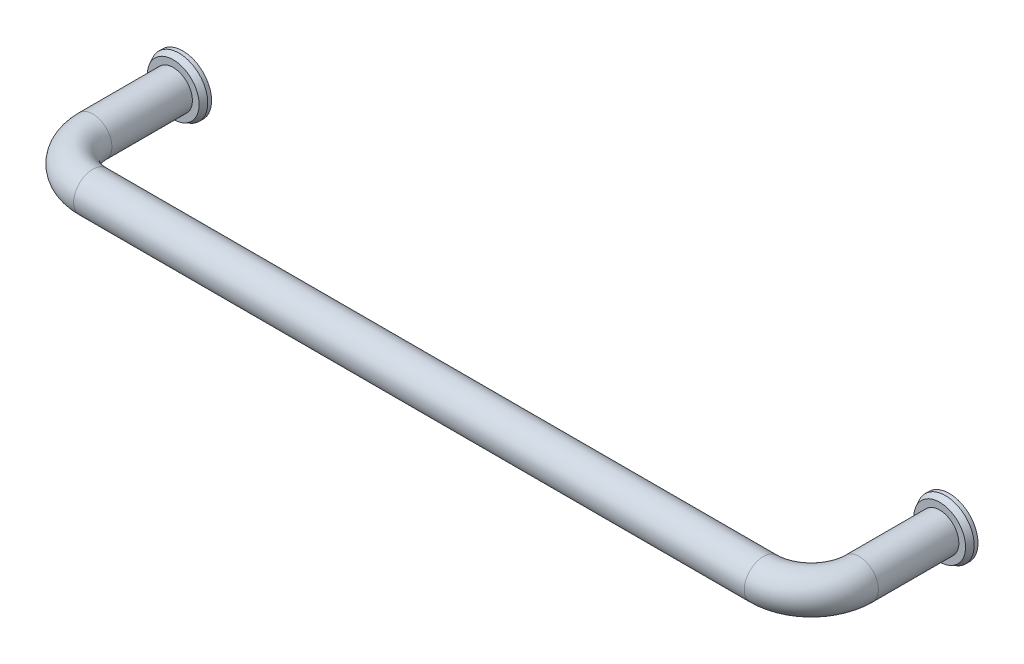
ISO-10303-21;
HEADER;
FILE_DESCRIPTION(('STEP AP214'),'2;1');
FILE_NAME('part.step','',(''),(''),'','','');
FILE_SCHEMA(('AUTOMOTIVE_DESIGN { 1 0 10303 214 1 1 1 1 }'));
ENDSEC;
DATA;
#1=APPLICATION_CONTEXT('core data for automotive mechanical design processes');
#2=APPLICATION_PROTOCOL_DEFINITION('international standard','automotive_design',2000,#1);
#3=PRODUCT_CONTEXT('',#1,'mechanical');
#4=PRODUCT('Part','Part','',(#3));
#5=PRODUCT_RELATED_PRODUCT_CATEGORY('part','',(#4));
#6=PRODUCT_DEFINITION_FORMATION('','',#4);
#7=PRODUCT_DEFINITION_CONTEXT('part definition',#1,'design');
#8=PRODUCT_DEFINITION('design','',#6,#7);
#9=PRODUCT_DEFINITION_SHAPE('','',#8);
#10=(LENGTH_UNIT() NAMED_UNIT(*) SI_UNIT(.MILLI.,.METRE.));
#11=(NAMED_UNIT(*) PLANE_ANGLE_UNIT() SI_UNIT($,.RADIAN.));
#12=(NAMED_UNIT(*) SI_UNIT($,.STERADIAN.) SOLID_ANGLE_UNIT());
#13=UNCERTAINTY_MEASURE_WITH_UNIT(LENGTH_MEASURE(1.E-05),#10,'distance_accuracy_value','');
#14=(GEOMETRIC_REPRESENTATION_CONTEXT(3) GLOBAL_UNCERTAINTY_ASSIGNED_CONTEXT((#13)) GLOBAL_UNIT_ASSIGNED_CONTEXT((#10,
#11,#12)) REPRESENTATION_CONTEXT('',''));
#15=CARTESIAN_POINT('',(0.,0.,0.));
#16=DIRECTION('',(0.,0.,1.));
#17=DIRECTION('',(1.,0.,0.));
#18=AXIS2_PLACEMENT_3D('',#15,#16,#17);
#19=CARTESIAN_POINT('',(0.,0.,0.));
#20=DIRECTION('',(0.,0.,-1.));
#21=DIRECTION('',(0.,1.,0.));
#22=AXIS2_PLACEMENT_3D('',#19,#20,#21);
#23=PLANE('',#22);
#24=CARTESIAN_POINT('',(0.,0.,0.));
#25=DIRECTION('',(0.,0.,1.));
#26=DIRECTION('',(0.,-1.,0.));
#27=AXIS2_PLACEMENT_3D('',#24,#25,#26);
#28=CIRCLE('',#27,7.5);
#29=CARTESIAN_POINT('',(0.,-7.5,0.));
#30=VERTEX_POINT('',#29);
#31=EDGE_CURVE('E56',#30,#30,#28,.T.);
#32=ORIENTED_EDGE('',*,*,#31,.F.);
#33=EDGE_LOOP('',(#32));
#34=FACE_BOUND('',#33,.T.);
#35=CARTESIAN_POINT('',(0.,0.,0.));
#36=DIRECTION('',(0.,0.,1.));
#37=DIRECTION('',(0.,-1.,0.));
#38=AXIS2_PLACEMENT_3D('',#35,#36,#37);
#39=CIRCLE('',#38,2.5);
#40=CARTESIAN_POINT('',(0.,-2.5,0.));
#41=VERTEX_POINT('',#40);
#42=EDGE_CURVE('E62',#41,#41,#39,.T.);
#43=ORIENTED_EDGE('',*,*,#42,.T.);
#44=EDGE_LOOP('',(#43));
#45=FACE_BOUND('',#44,.T.);
#46=ADVANCED_FACE('F12',(#34,#45),#23,.T.);
#47=CARTESIAN_POINT('',(0.,0.,23.5));
#48=DIRECTION('',(0.,0.,-1.));
#49=DIRECTION('',(0.,-1.,0.));
#50=AXIS2_PLACEMENT_3D('',#47,#48,#49);
#51=CYLINDRICAL_SURFACE('',#50,5.);
#52=CARTESIAN_POINT('',(0.,0.,23.5));
#53=DIRECTION('',(0.,0.,-1.));
#54=DIRECTION('',(0.,1.,0.));
#55=AXIS2_PLACEMENT_3D('',#52,#53,#54);
#56=CIRCLE('',#55,5.);
#57=CARTESIAN_POINT('',(-5.,0.,23.5));
#58=VERTEX_POINT('',#57);
#59=EDGE_CURVE('E20',#58,#58,#56,.T.);
#60=ORIENTED_EDGE('',*,*,#59,.T.);
#61=EDGE_LOOP('',(#60));
#62=FACE_BOUND('',#61,.T.);
#63=CARTESIAN_POINT('',(0.,0.,2.5));
#64=DIRECTION('',(0.,0.,-1.));
#65=DIRECTION('',(0.,-1.,0.));
#66=AXIS2_PLACEMENT_3D('',#63,#64,#65);
#67=CIRCLE('',#66,5.);
#68=CARTESIAN_POINT('',(0.,-5.,2.5));
#69=VERTEX_POINT('',#68);
#70=EDGE_CURVE('E16',#69,#69,#67,.F.);
#71=ORIENTED_EDGE('',*,*,#70,.T.);
#72=EDGE_LOOP('',(#71));
#73=FACE_BOUND('',#72,.T.);
#74=ADVANCED_FACE('F14',(#62,#73),#51,.T.);
#75=CARTESIAN_POINT('',(200.,0.,23.5));
#76=DIRECTION('',(0.,0.,-1.));
#77=DIRECTION('',(0.,-1.,0.));
#78=AXIS2_PLACEMENT_3D('',#75,#76,#77);
#79=CYLINDRICAL_SURFACE('',#78,5.);
#80=CARTESIAN_POINT('',(200.,0.,23.5));
#81=DIRECTION('',(0.,0.,1.));
#82=DIRECTION('',(0.,1.,0.));
#83=AXIS2_PLACEMENT_3D('',#80,#81,#82);
#84=CIRCLE('',#83,5.);
#85=CARTESIAN_POINT('',(205.,0.,23.5));
#86=VERTEX_POINT('',#85);
#87=EDGE_CURVE('E32',#86,#86,#84,.T.);
#88=ORIENTED_EDGE('',*,*,#87,.F.);
#89=EDGE_LOOP('',(#88));
#90=FACE_BOUND('',#89,.T.);
#91=CARTESIAN_POINT('',(200.,0.,2.5));
#92=DIRECTION('',(0.,0.,-1.));
#93=DIRECTION('',(0.,-1.,0.));
#94=AXIS2_PLACEMENT_3D('',#91,#92,#93);
#95=CIRCLE('',#94,5.);
#96=CARTESIAN_POINT('',(200.,-5.,2.5));
#97=VERTEX_POINT('',#96);
#98=EDGE_CURVE('E8',#97,#97,#95,.T.);
#99=ORIENTED_EDGE('',*,*,#98,.F.);
#100=EDGE_LOOP('',(#99));
#101=FACE_BOUND('',#100,.T.);
#102=ADVANCED_FACE('F91',(#90,#101),#79,.T.);
#103=CARTESIAN_POINT('',(12.5,0.,23.5));
#104=DIRECTION('',(0.,-1.,0.));
#105=DIRECTION('',(1.,0.,0.));
#106=AXIS2_PLACEMENT_3D('',#103,#104,#105);
#107=TOROIDAL_SURFACE('',#106,12.5,5.);
#108=CARTESIAN_POINT('',(12.5,0.,36.));
#109=DIRECTION('',(-1.,0.,0.));
#110=DIRECTION('',(0.,1.,0.));
#111=AXIS2_PLACEMENT_3D('',#108,#109,#110);
#112=CIRCLE('',#111,5.);
#113=CARTESIAN_POINT('',(12.5,0.,41.));
#114=VERTEX_POINT('',#113);
#115=EDGE_CURVE('E24',#114,#114,#112,.T.);
#116=CARTESIAN_POINT('',(12.5,0.,23.5));
#117=DIRECTION('',(0.,-1.,0.));
#118=DIRECTION('',(1.,0.,0.));
#119=AXIS2_PLACEMENT_3D('',#116,#117,#118);
#120=CIRCLE('',#119,17.5);
#121=EDGE_CURVE('',#114,#58,#120,.T.);
#122=ORIENTED_EDGE('',*,*,#115,.T.);
#123=ORIENTED_EDGE('',*,*,#59,.F.);
#124=ORIENTED_EDGE('',*,*,#121,.T.);
#125=ORIENTED_EDGE('',*,*,#121,.F.);
#126=EDGE_LOOP('',(#122,#124,#123,#125));
#127=FACE_BOUND('',#126,.T.);
#128=ADVANCED_FACE('F100',(#127),#107,.T.);
#129=CARTESIAN_POINT('',(187.5,0.,36.));
#130=DIRECTION('',(-1.,0.,0.));
#131=DIRECTION('',(0.,-1.,0.));
#132=AXIS2_PLACEMENT_3D('',#129,#130,#131);
#133=CYLINDRICAL_SURFACE('',#132,5.);
#134=CARTESIAN_POINT('',(187.5,0.,36.));
#135=DIRECTION('',(-1.,0.,0.));
#136=DIRECTION('',(0.,1.,0.));
#137=AXIS2_PLACEMENT_3D('',#134,#135,#136);
#138=CIRCLE('',#137,5.);
#139=CARTESIAN_POINT('',(187.5,0.,41.));
#140=VERTEX_POINT('',#139);
#141=EDGE_CURVE('E29',#140,#140,#138,.T.);
#142=ORIENTED_EDGE('',*,*,#141,.T.);
#143=EDGE_LOOP('',(#142));
#144=FACE_BOUND('',#143,.T.);
#145=ORIENTED_EDGE('',*,*,#115,.F.);
#146=EDGE_LOOP('',(#145));
#147=FACE_BOUND('',#146,.T.);
#148=ADVANCED_FACE('F106',(#144,#147),#133,.T.);
#149=CARTESIAN_POINT('',(187.5,0.,23.5));
#150=DIRECTION('',(0.,-1.,0.));
#151=DIRECTION('',(1.,0.,0.));
#152=AXIS2_PLACEMENT_3D('',#149,#150,#151);
#153=TOROIDAL_SURFACE('',#152,12.5,5.);
#154=CARTESIAN_POINT('',(187.5,0.,23.5));
#155=DIRECTION('',(0.,-1.,0.));
#156=DIRECTION('',(1.,0.,0.));
#157=AXIS2_PLACEMENT_3D('',#154,#155,#156);
#158=CIRCLE('',#157,17.5);
#159=EDGE_CURVE('',#86,#140,#158,.T.);
#160=ORIENTED_EDGE('',*,*,#87,.T.);
#161=ORIENTED_EDGE('',*,*,#141,.F.);
#162=ORIENTED_EDGE('',*,*,#159,.T.);
#163=ORIENTED_EDGE('',*,*,#159,.F.);
#164=EDGE_LOOP('',(#160,#162,#161,#163));
#165=FACE_BOUND('',#164,.T.);
#166=ADVANCED_FACE('F102',(#165),#153,.T.);
#167=CARTESIAN_POINT('',(200.,0.,2.5));
#168=DIRECTION('',(0.,0.,-1.));
#169=DIRECTION('',(0.,-1.,0.));
#170=AXIS2_PLACEMENT_3D('',#167,#168,#169);
#171=PLANE('',#170);
#172=CARTESIAN_POINT('',(200.,0.,2.5));
#173=DIRECTION('',(0.,0.,-1.));
#174=DIRECTION('',(0.,-1.,0.));
#175=AXIS2_PLACEMENT_3D('',#172,#173,#174);
#176=CIRCLE('',#175,6.75);
#177=CARTESIAN_POINT('',(200.,-6.75,2.5));
#178=VERTEX_POINT('',#177);
#179=EDGE_CURVE('E35',#178,#178,#176,.T.);
#180=ORIENTED_EDGE('',*,*,#179,.F.);
#181=EDGE_LOOP('',(#180));
#182=FACE_BOUND('',#181,.T.);
#183=ORIENTED_EDGE('',*,*,#98,.T.);
#184=EDGE_LOOP('',(#183));
#185=FACE_BOUND('',#184,.T.);
#186=ADVANCED_FACE('F105',(#182,#185),#171,.F.);
#187=CARTESIAN_POINT('',(200.,0.,2.5));
#188=DIRECTION('',(0.,0.,-1.));
#189=DIRECTION('',(0.,-1.,0.));
#190=AXIS2_PLACEMENT_3D('',#187,#188,#189);
#191=CONICAL_SURFACE('',#190,6.75,0.463647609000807);
#192=CARTESIAN_POINT('',(200.,0.,0.999999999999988));
#193=DIRECTION('',(0.,0.,-1.));
#194=DIRECTION('',(0.,-1.,0.));
#195=AXIS2_PLACEMENT_3D('',#192,#193,#194);
#196=CIRCLE('',#195,7.5);
#197=CARTESIAN_POINT('',(200.,-7.5,0.999999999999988));
#198=VERTEX_POINT('',#197);
#199=EDGE_CURVE('E38',#198,#198,#196,.T.);
#200=ORIENTED_EDGE('',*,*,#199,.F.);
#201=EDGE_LOOP('',(#200));
#202=FACE_BOUND('',#201,.T.);
#203=ORIENTED_EDGE('',*,*,#179,.T.);
#204=EDGE_LOOP('',(#203));
#205=FACE_BOUND('',#204,.T.);
#206=ADVANCED_FACE('F146',(#202,#205),#191,.T.);
#207=CARTESIAN_POINT('',(200.,0.,0.));
#208=DIRECTION('',(0.,0.,-1.));
#209=DIRECTION('',(0.,-1.,0.));
#210=AXIS2_PLACEMENT_3D('',#207,#208,#209);
#211=CYLINDRICAL_SURFACE('',#210,7.5);
#212=CARTESIAN_POINT('',(200.,0.,0.));
#213=DIRECTION('',(0.,0.,-1.));
#214=DIRECTION('',(0.,-1.,0.));
#215=AXIS2_PLACEMENT_3D('',#212,#213,#214);
#216=CIRCLE('',#215,7.5);
#217=CARTESIAN_POINT('',(200.,-7.5,0.));
#218=VERTEX_POINT('',#217);
#219=EDGE_CURVE('E41',#218,#218,#216,.T.);
#220=ORIENTED_EDGE('',*,*,#219,.F.);
#221=EDGE_LOOP('',(#220));
#222=FACE_BOUND('',#221,.T.);
#223=ORIENTED_EDGE('',*,*,#199,.T.);
#224=EDGE_LOOP('',(#223));
#225=FACE_BOUND('',#224,.T.);
#226=ADVANCED_FACE('F143',(#222,#225),#211,.T.);
#227=CARTESIAN_POINT('',(200.,0.,0.));
#228=DIRECTION('',(0.,0.,1.));
#229=DIRECTION('',(0.,1.,0.));
#230=AXIS2_PLACEMENT_3D('',#227,#228,#229);
#231=PLANE('',#230);
#232=CARTESIAN_POINT('',(200.,0.,0.));
#233=DIRECTION('',(0.,0.,-1.));
#234=DIRECTION('',(0.,-1.,0.));
#235=AXIS2_PLACEMENT_3D('',#232,#233,#234);
#236=CIRCLE('',#235,2.5);
#237=CARTESIAN_POINT('',(200.,-2.5,0.));
#238=VERTEX_POINT('',#237);
#239=EDGE_CURVE('E47',#238,#238,#236,.T.);
#240=ORIENTED_EDGE('',*,*,#239,.F.);
#241=EDGE_LOOP('',(#240));
#242=FACE_BOUND('',#241,.T.);
#243=ORIENTED_EDGE('',*,*,#219,.T.);
#244=EDGE_LOOP('',(#243));
#245=FACE_BOUND('',#244,.T.);
#246=ADVANCED_FACE('F96',(#242,#245),#231,.F.);
#247=CARTESIAN_POINT('',(200.,0.,11.));
#248=DIRECTION('',(0.,0.,-1.));
#249=DIRECTION('',(0.,-1.,0.));
#250=AXIS2_PLACEMENT_3D('',#247,#248,#249);
#251=CYLINDRICAL_SURFACE('',#250,2.5);
#252=CARTESIAN_POINT('',(200.,0.,11.));
#253=DIRECTION('',(0.,0.,-1.));
#254=DIRECTION('',(0.,-1.,0.));
#255=AXIS2_PLACEMENT_3D('',#252,#253,#254);
#256=CIRCLE('',#255,2.5);
#257=CARTESIAN_POINT('',(200.,-2.5,11.));
#258=VERTEX_POINT('',#257);
#259=EDGE_CURVE('E44',#258,#258,#256,.T.);
#260=ORIENTED_EDGE('',*,*,#259,.F.);
#261=EDGE_LOOP('',(#260));
#262=FACE_BOUND('',#261,.T.);
#263=ORIENTED_EDGE('',*,*,#239,.T.);
#264=EDGE_LOOP('',(#263));
#265=FACE_BOUND('',#264,.T.);
#266=ADVANCED_FACE('F127',(#262,#265),#251,.F.);
#267=CARTESIAN_POINT('',(200.,0.,11.));
#268=DIRECTION('',(0.,0.,-1.));
#269=DIRECTION('',(0.,-1.,0.));
#270=AXIS2_PLACEMENT_3D('',#267,#268,#269);
#271=PLANE('',#270);
#272=ORIENTED_EDGE('',*,*,#259,.T.);
#273=EDGE_LOOP('',(#272));
#274=FACE_BOUND('',#273,.T.);
#275=ADVANCED_FACE('F125',(#274),#271,.T.);
#276=CARTESIAN_POINT('',(0.,0.,2.5));
#277=DIRECTION('',(0.,0.,-1.));
#278=DIRECTION('',(0.,-1.,0.));
#279=AXIS2_PLACEMENT_3D('',#276,#277,#278);
#280=PLANE('',#279);
#281=ORIENTED_EDGE('',*,*,#70,.F.);
#282=EDGE_LOOP('',(#281));
#283=FACE_BOUND('',#282,.T.);
#284=CARTESIAN_POINT('',(0.,0.,2.5));
#285=DIRECTION('',(0.,0.,1.));
#286=DIRECTION('',(0.,-1.,0.));
#287=AXIS2_PLACEMENT_3D('',#284,#285,#286);
#288=CIRCLE('',#287,6.75);
#289=CARTESIAN_POINT('',(0.,-6.75,2.5));
#290=VERTEX_POINT('',#289);
#291=EDGE_CURVE('E50',#290,#290,#288,.T.);
#292=ORIENTED_EDGE('',*,*,#291,.T.);
#293=EDGE_LOOP('',(#292));
#294=FACE_BOUND('',#293,.T.);
#295=ADVANCED_FACE('F122',(#283,#294),#280,.F.);
#296=CARTESIAN_POINT('',(0.,0.,2.5));
#297=DIRECTION('',(0.,0.,-1.));
#298=DIRECTION('',(0.,-1.,0.));
#299=AXIS2_PLACEMENT_3D('',#296,#297,#298);
#300=CONICAL_SURFACE('',#299,6.75,0.463647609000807);
#301=CARTESIAN_POINT('',(0.,0.,0.999999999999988));
#302=DIRECTION('',(0.,0.,1.));
#303=DIRECTION('',(0.,-1.,0.));
#304=AXIS2_PLACEMENT_3D('',#301,#302,#303);
#305=CIRCLE('',#304,7.5);
#306=CARTESIAN_POINT('',(0.,-7.5,0.999999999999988));
#307=VERTEX_POINT('',#306);
#308=EDGE_CURVE('E53',#307,#307,#305,.T.);
#309=ORIENTED_EDGE('',*,*,#308,.T.);
#310=EDGE_LOOP('',(#309));
#311=FACE_BOUND('',#310,.T.);
#312=ORIENTED_EDGE('',*,*,#291,.F.);
#313=EDGE_LOOP('',(#312));
#314=FACE_BOUND('',#313,.T.);
#315=ADVANCED_FACE('F81',(#311,#314),#300,.T.);
#316=CARTESIAN_POINT('',(0.,0.,0.));
#317=DIRECTION('',(0.,0.,-1.));
#318=DIRECTION('',(0.,-1.,0.));
#319=AXIS2_PLACEMENT_3D('',#316,#317,#318);
#320=CYLINDRICAL_SURFACE('',#319,7.5);
#321=ORIENTED_EDGE('',*,*,#31,.T.);
#322=EDGE_LOOP('',(#321));
#323=FACE_BOUND('',#322,.T.);
#324=ORIENTED_EDGE('',*,*,#308,.F.);
#325=EDGE_LOOP('',(#324));
#326=FACE_BOUND('',#325,.T.);
#327=ADVANCED_FACE('F70',(#323,#326),#320,.T.);
#328=CARTESIAN_POINT('',(0.,0.,11.));
#329=DIRECTION('',(0.,0.,-1.));
#330=DIRECTION('',(0.,-1.,0.));
#331=AXIS2_PLACEMENT_3D('',#328,#329,#330);
#332=CYLINDRICAL_SURFACE('',#331,2.5);
#333=CARTESIAN_POINT('',(0.,0.,11.));
#334=DIRECTION('',(0.,0.,1.));
#335=DIRECTION('',(0.,-1.,0.));
#336=AXIS2_PLACEMENT_3D('',#333,#334,#335);
#337=CIRCLE('',#336,2.5);
#338=CARTESIAN_POINT('',(0.,-2.5,11.));
#339=VERTEX_POINT('',#338);
#340=EDGE_CURVE('E59',#339,#339,#337,.T.);
#341=ORIENTED_EDGE('',*,*,#340,.T.);
#342=EDGE_LOOP('',(#341));
#343=FACE_BOUND('',#342,.T.);
#344=ORIENTED_EDGE('',*,*,#42,.F.);
#345=EDGE_LOOP('',(#344));
#346=FACE_BOUND('',#345,.T.);
#347=ADVANCED_FACE('F67',(#343,#346),#332,.F.);
#348=CARTESIAN_POINT('',(0.,0.,11.));
#349=DIRECTION('',(0.,0.,-1.));
#350=DIRECTION('',(0.,-1.,0.));
#351=AXIS2_PLACEMENT_3D('',#348,#349,#350);
#352=PLANE('',#351);
#353=ORIENTED_EDGE('',*,*,#340,.F.);
#354=EDGE_LOOP('',(#353));
#355=FACE_BOUND('',#354,.T.);
#356=ADVANCED_FACE('F69',(#355),#352,.T.);
#357=CLOSED_SHELL('',(#46,#74,#102,#128,#148,#166,#186,#206,#226,#246,#266,#275,#295,#315,#327,
#347,#356));
#358=MANIFOLD_SOLID_BREP('B1',#357);
#359=ADVANCED_BREP_SHAPE_REPRESENTATION('',(#18,#358),#14);
#360=SHAPE_DEFINITION_REPRESENTATION(#9,#359);
ENDSEC;
END-ISO-10303-21;
